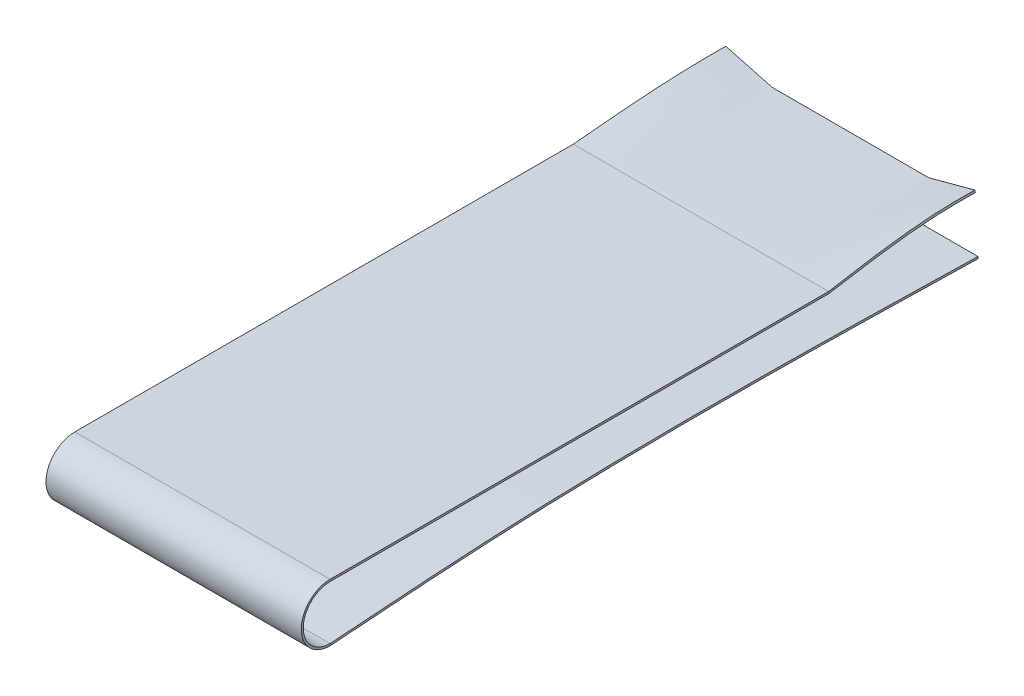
from build123d import *

# Parameters (mm, degrees)
ESQUISSE1_W       = 1280
ESQUISSE1_H       = 10
EXTRUSION1_DEPTH  = 2500
ESQUISSE2_W       = 1280
ESQUISSE2_H       = 10
R_VOLUTION1_ANGLE = 180


with BuildPart() as part:
    # Esquisse1 → Extrusion1 (new body)
    with BuildSketch(Plane.XY):
        with Locations((0, 30.324396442)):
            Rectangle(ESQUISSE1_W, ESQUISSE1_H)
    extrude(amount=EXTRUSION1_DEPTH)

    # Esquisse2 → R_volution1 (revolve)
    with BuildSketch(Plane.XY.offset(2500)):
        with Locations((0, 30.324396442)):
            Rectangle(ESQUISSE2_W, ESQUISSE2_H)
    revolve(axis=Axis((-119.055950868, -109.175603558, 2500), (1, 0, 0)), revolution_arc=R_VOLUTION1_ANGLE)


solid = part.part
